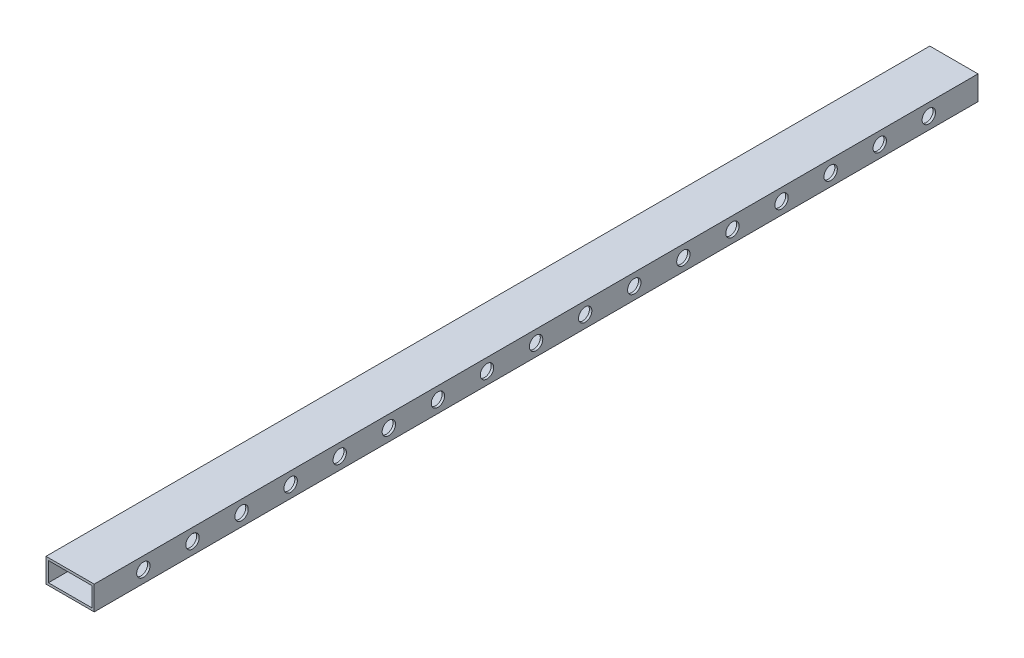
from build123d import *

# Parameters (mm, degrees)
ESQUISSE1_W                     = 60
ESQUISSE1_H                     = 30
ESQUISSE1_W_2                   = 54
ESQUISSE1_H_2                   = 24
EXTRU_MINCE1_DEPTH              = 1100
TROU_TARAUD_1_2_RC1_AT_2_COUNT  = 2
TROU_TARAUD_1_2_RC1_AT_2_PITCH  = 61.1
TROU_TARAUD_1_2_RC1_AT_3_COUNT  = 2
TROU_TARAUD_1_2_RC1_AT_3_PITCH  = 122.2
TROU_TARAUD_1_2_RC1_AT_4_COUNT  = 2
TROU_TARAUD_1_2_RC1_AT_4_PITCH  = 183.3
TROU_TARAUD_1_2_RC1_AT_5_COUNT  = 2
TROU_TARAUD_1_2_RC1_AT_5_PITCH  = 244.4
TROU_TARAUD_1_2_RC1_AT_6_COUNT  = 2
TROU_TARAUD_1_2_RC1_AT_6_PITCH  = 305.5
TROU_TARAUD_1_2_RC1_AT_7_COUNT  = 2
TROU_TARAUD_1_2_RC1_AT_7_PITCH  = 366.6
TROU_TARAUD_1_2_RC1_AT_8_COUNT  = 2
TROU_TARAUD_1_2_RC1_AT_8_PITCH  = 427.7
TROU_TARAUD_1_2_RC1_AT_9_COUNT  = 2
TROU_TARAUD_1_2_RC1_AT_9_PITCH  = 488.8
TROU_TARAUD_1_2_RC1_AT_10_COUNT = 2
TROU_TARAUD_1_2_RC1_AT_10_PITCH = 427.7
TROU_TARAUD_1_2_RC1_AT_11_COUNT = 2
TROU_TARAUD_1_2_RC1_AT_11_PITCH = 488.8
TROU_TARAUD_1_2_RC1_AT_12_COUNT = 2
TROU_TARAUD_1_2_RC1_AT_12_PITCH = 366.6
TROU_TARAUD_1_2_RC1_AT_13_COUNT = 2
TROU_TARAUD_1_2_RC1_AT_13_PITCH = 305.5
TROU_TARAUD_1_2_RC1_AT_14_COUNT = 2
TROU_TARAUD_1_2_RC1_AT_14_PITCH = 244.4
TROU_TARAUD_1_2_RC1_AT_15_COUNT = 2
TROU_TARAUD_1_2_RC1_AT_15_PITCH = 183.3
TROU_TARAUD_1_2_RC1_AT_16_COUNT = 2
TROU_TARAUD_1_2_RC1_AT_16_PITCH = 122.2
TROU_TARAUD_1_2_RC1_AT_17_COUNT = 2
TROU_TARAUD_1_2_RC1_AT_17_PITCH = 61.1


with BuildPart() as part:
    # Esquisse1 → Extru.-Mince1 (new body)
    with BuildSketch(Plane.XY):
        Rectangle(ESQUISSE1_W, ESQUISSE1_H)
        Rectangle(ESQUISSE1_W_2, ESQUISSE1_H_2, mode=Mode.SUBTRACT)
    extrude(amount=EXTRU_MINCE1_DEPTH)

    # Esquisse4 → Trou taraud_ 1_2 Rc1 (revolve, cut)
    with BuildSketch(Plane(origin=(30, 0, 550), x_dir=(0, 0, -1), z_dir=(0, 1, 0))):
        Polygon((0, 0), (0, 29.327530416), (8.75, 24.07), (8.75, 15), (7.847250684, 15), (8.3155, 0), align=None)
    trou_taraud_1_2_rc1 = revolve(axis=Axis((36.35, 0, 550), (-1, 0, 0)), mode=Mode.SUBTRACT)

    # Trou taraud_ 1_2 Rc1 at 2: Trou taraud_ 1_2 Rc1 ×2
    with Locations(*[(0, 0, -i * TROU_TARAUD_1_2_RC1_AT_2_PITCH) for i in range(1, TROU_TARAUD_1_2_RC1_AT_2_COUNT)]):
        add(trou_taraud_1_2_rc1, mode=Mode.SUBTRACT)

    # Trou taraud_ 1_2 Rc1 at 3: Trou taraud_ 1_2 Rc1 ×2
    with Locations(*[(0, 0, -i * TROU_TARAUD_1_2_RC1_AT_3_PITCH) for i in range(1, TROU_TARAUD_1_2_RC1_AT_3_COUNT)]):
        add(trou_taraud_1_2_rc1, mode=Mode.SUBTRACT)

    # Trou taraud_ 1_2 Rc1 at 4: Trou taraud_ 1_2 Rc1 ×2
    with Locations(*[(0, 0, -i * TROU_TARAUD_1_2_RC1_AT_4_PITCH) for i in range(1, TROU_TARAUD_1_2_RC1_AT_4_COUNT)]):
        add(trou_taraud_1_2_rc1, mode=Mode.SUBTRACT)

    # Trou taraud_ 1_2 Rc1 at 5: Trou taraud_ 1_2 Rc1 ×2
    with Locations(*[(0, 0, -i * TROU_TARAUD_1_2_RC1_AT_5_PITCH) for i in range(1, TROU_TARAUD_1_2_RC1_AT_5_COUNT)]):
        add(trou_taraud_1_2_rc1, mode=Mode.SUBTRACT)

    # Trou taraud_ 1_2 Rc1 at 6: Trou taraud_ 1_2 Rc1 ×2
    with Locations(*[(0, 0, -i * TROU_TARAUD_1_2_RC1_AT_6_PITCH) for i in range(1, TROU_TARAUD_1_2_RC1_AT_6_COUNT)]):
        add(trou_taraud_1_2_rc1, mode=Mode.SUBTRACT)

    # Trou taraud_ 1_2 Rc1 at 7: Trou taraud_ 1_2 Rc1 ×2
    with Locations(*[(0, 0, -i * TROU_TARAUD_1_2_RC1_AT_7_PITCH) for i in range(1, TROU_TARAUD_1_2_RC1_AT_7_COUNT)]):
        add(trou_taraud_1_2_rc1, mode=Mode.SUBTRACT)

    # Trou taraud_ 1_2 Rc1 at 8: Trou taraud_ 1_2 Rc1 ×2
    with Locations(*[(0, 0, -i * TROU_TARAUD_1_2_RC1_AT_8_PITCH) for i in range(1, TROU_TARAUD_1_2_RC1_AT_8_COUNT)]):
        add(trou_taraud_1_2_rc1, mode=Mode.SUBTRACT)

    # Trou taraud_ 1_2 Rc1 at 9: Trou taraud_ 1_2 Rc1 ×2
    with Locations(*[(0, 0, -i * TROU_TARAUD_1_2_RC1_AT_9_PITCH) for i in range(1, TROU_TARAUD_1_2_RC1_AT_9_COUNT)]):
        add(trou_taraud_1_2_rc1, mode=Mode.SUBTRACT)

    # Trou taraud_ 1_2 Rc1 at 10: Trou taraud_ 1_2 Rc1 ×2
    with Locations(*[(0, 0, i * TROU_TARAUD_1_2_RC1_AT_10_PITCH) for i in range(1, TROU_TARAUD_1_2_RC1_AT_10_COUNT)]):
        add(trou_taraud_1_2_rc1, mode=Mode.SUBTRACT)

    # Trou taraud_ 1_2 Rc1 at 11: Trou taraud_ 1_2 Rc1 ×2
    with Locations(*[(0, 0, i * TROU_TARAUD_1_2_RC1_AT_11_PITCH) for i in range(1, TROU_TARAUD_1_2_RC1_AT_11_COUNT)]):
        add(trou_taraud_1_2_rc1, mode=Mode.SUBTRACT)

    # Trou taraud_ 1_2 Rc1 at 12: Trou taraud_ 1_2 Rc1 ×2
    with Locations(*[(0, 0, i * TROU_TARAUD_1_2_RC1_AT_12_PITCH) for i in range(1, TROU_TARAUD_1_2_RC1_AT_12_COUNT)]):
        add(trou_taraud_1_2_rc1, mode=Mode.SUBTRACT)

    # Trou taraud_ 1_2 Rc1 at 13: Trou taraud_ 1_2 Rc1 ×2
    with Locations(*[(0, 0, i * TROU_TARAUD_1_2_RC1_AT_13_PITCH) for i in range(1, TROU_TARAUD_1_2_RC1_AT_13_COUNT)]):
        add(trou_taraud_1_2_rc1, mode=Mode.SUBTRACT)

    # Trou taraud_ 1_2 Rc1 at 14: Trou taraud_ 1_2 Rc1 ×2
    with Locations(*[(0, 0, i * TROU_TARAUD_1_2_RC1_AT_14_PITCH) for i in range(1, TROU_TARAUD_1_2_RC1_AT_14_COUNT)]):
        add(trou_taraud_1_2_rc1, mode=Mode.SUBTRACT)

    # Trou taraud_ 1_2 Rc1 at 15: Trou taraud_ 1_2 Rc1 ×2
    with Locations(*[(0, 0, i * TROU_TARAUD_1_2_RC1_AT_15_PITCH) for i in range(1, TROU_TARAUD_1_2_RC1_AT_15_COUNT)]):
        add(trou_taraud_1_2_rc1, mode=Mode.SUBTRACT)

    # Trou taraud_ 1_2 Rc1 at 16: Trou taraud_ 1_2 Rc1 ×2
    with Locations(*[(0, 0, i * TROU_TARAUD_1_2_RC1_AT_16_PITCH) for i in range(1, TROU_TARAUD_1_2_RC1_AT_16_COUNT)]):
        add(trou_taraud_1_2_rc1, mode=Mode.SUBTRACT)

    # Trou taraud_ 1_2 Rc1 at 17: Trou taraud_ 1_2 Rc1 ×2
    with Locations(*[(0, 0, i * TROU_TARAUD_1_2_RC1_AT_17_PITCH) for i in range(1, TROU_TARAUD_1_2_RC1_AT_17_COUNT)]):
        add(trou_taraud_1_2_rc1, mode=Mode.SUBTRACT)

    # Esquisse9 → Trou taraud_ 3_4 Rc2 (revolve, cut)
    with BuildSketch(Plane(origin=(0, -15, 950), x_dir=(0, 0, -1), z_dir=(1, 0, 0))):
        Polygon((0, 0), (0, 12.279897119), (11.5, 5.37), (11.5, 16.3), (11.549669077, 16.3), (12.0585, 0), align=None)
    revolve(axis=Axis((0, -21.35, 950), (0, 1, 0)), mode=Mode.SUBTRACT)


solid = part.part
